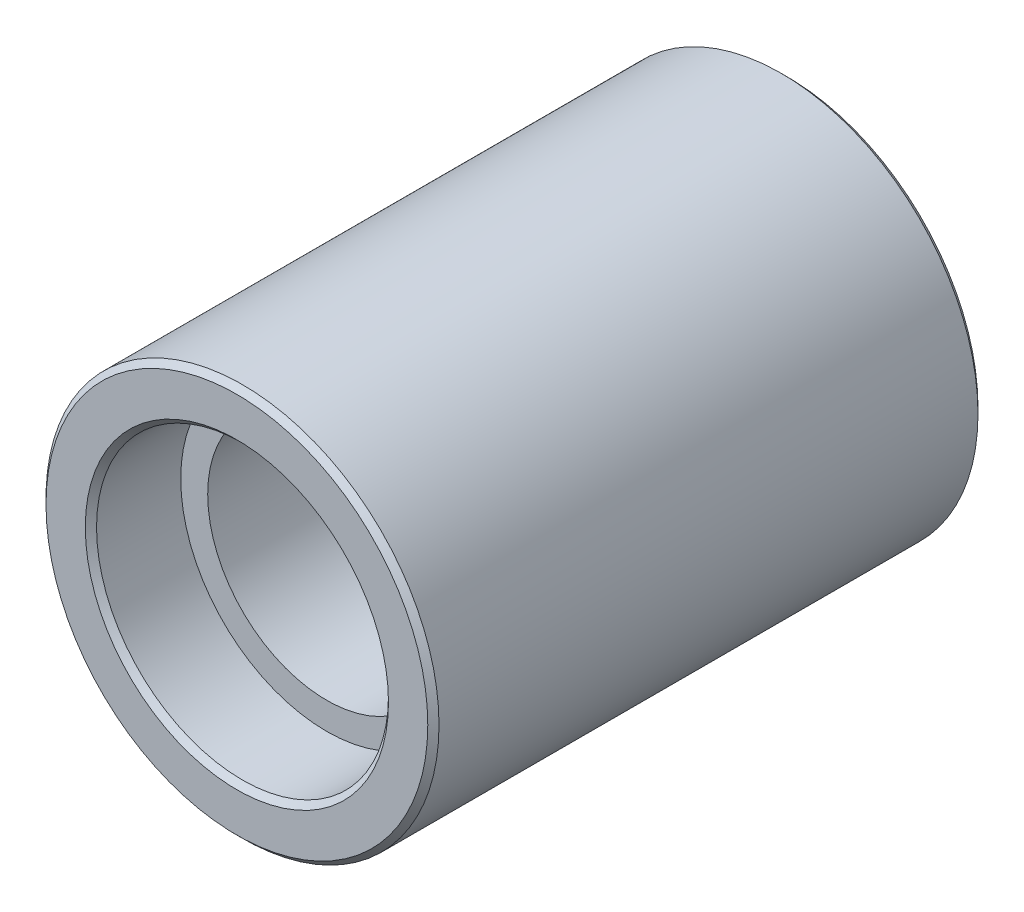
ISO-10303-21;
HEADER;
FILE_DESCRIPTION(('STEP AP214'),'2;1');
FILE_NAME('part.step','',(''),(''),'','','');
FILE_SCHEMA(('AUTOMOTIVE_DESIGN { 1 0 10303 214 1 1 1 1 }'));
ENDSEC;
DATA;
#1=APPLICATION_CONTEXT('core data for automotive mechanical design processes');
#2=APPLICATION_PROTOCOL_DEFINITION('international standard','automotive_design',2000,#1);
#3=PRODUCT_CONTEXT('',#1,'mechanical');
#4=PRODUCT('Part','Part','',(#3));
#5=PRODUCT_RELATED_PRODUCT_CATEGORY('part','',(#4));
#6=PRODUCT_DEFINITION_FORMATION('','',#4);
#7=PRODUCT_DEFINITION_CONTEXT('part definition',#1,'design');
#8=PRODUCT_DEFINITION('design','',#6,#7);
#9=PRODUCT_DEFINITION_SHAPE('','',#8);
#10=(LENGTH_UNIT() NAMED_UNIT(*) SI_UNIT(.MILLI.,.METRE.));
#11=(NAMED_UNIT(*) PLANE_ANGLE_UNIT() SI_UNIT($,.RADIAN.));
#12=(NAMED_UNIT(*) SI_UNIT($,.STERADIAN.) SOLID_ANGLE_UNIT());
#13=UNCERTAINTY_MEASURE_WITH_UNIT(LENGTH_MEASURE(1.E-05),#10,'distance_accuracy_value','');
#14=(GEOMETRIC_REPRESENTATION_CONTEXT(3) GLOBAL_UNCERTAINTY_ASSIGNED_CONTEXT((#13)) GLOBAL_UNIT_ASSIGNED_CONTEXT((#10,
#11,#12)) REPRESENTATION_CONTEXT('',''));
#15=CARTESIAN_POINT('',(0.,0.,0.));
#16=DIRECTION('',(0.,0.,1.));
#17=DIRECTION('',(1.,0.,0.));
#18=AXIS2_PLACEMENT_3D('',#15,#16,#17);
#19=CARTESIAN_POINT('',(0.,0.,24.5));
#20=DIRECTION('',(0.,0.,-1.));
#21=DIRECTION('',(-1.,0.,0.));
#22=AXIS2_PLACEMENT_3D('',#19,#20,#21);
#23=CYLINDRICAL_SURFACE('',#22,10.6);
#24=CARTESIAN_POINT('',(0.,0.,-16.5));
#25=DIRECTION('',(0.,0.,-1.));
#26=DIRECTION('',(-1.,0.,0.));
#27=AXIS2_PLACEMENT_3D('',#24,#25,#26);
#28=CIRCLE('',#27,10.6);
#29=CARTESIAN_POINT('',(-10.6,0.,-16.5));
#30=VERTEX_POINT('',#29);
#31=EDGE_CURVE('E64',#30,#30,#28,.T.);
#32=ORIENTED_EDGE('',*,*,#31,.T.);
#33=EDGE_LOOP('',(#32));
#34=FACE_BOUND('',#33,.T.);
#35=CARTESIAN_POINT('',(0.,0.,16.5));
#36=DIRECTION('',(0.,0.,1.));
#37=DIRECTION('',(1.,0.,0.));
#38=AXIS2_PLACEMENT_3D('',#35,#36,#37);
#39=CIRCLE('',#38,10.6);
#40=CARTESIAN_POINT('',(10.6,0.,16.5));
#41=VERTEX_POINT('',#40);
#42=EDGE_CURVE('E61',#41,#41,#39,.F.);
#43=ORIENTED_EDGE('',*,*,#42,.F.);
#44=EDGE_LOOP('',(#43));
#45=FACE_BOUND('',#44,.T.);
#46=ADVANCED_FACE('F28',(#34,#45),#23,.F.);
#47=CARTESIAN_POINT('',(0.,0.,24.5));
#48=DIRECTION('',(0.,0.,-1.));
#49=DIRECTION('',(-1.,0.,0.));
#50=AXIS2_PLACEMENT_3D('',#47,#48,#49);
#51=CYLINDRICAL_SURFACE('',#50,17.5);
#52=CARTESIAN_POINT('',(0.,0.,-24.));
#53=DIRECTION('',(0.,0.,1.));
#54=DIRECTION('',(1.,0.,0.));
#55=AXIS2_PLACEMENT_3D('',#52,#53,#54);
#56=CIRCLE('',#55,17.5);
#57=CARTESIAN_POINT('',(17.5,0.,-24.));
#58=VERTEX_POINT('',#57);
#59=EDGE_CURVE('E54',#58,#58,#56,.T.);
#60=ORIENTED_EDGE('',*,*,#59,.T.);
#61=EDGE_LOOP('',(#60));
#62=FACE_BOUND('',#61,.T.);
#63=CARTESIAN_POINT('',(0.,0.,24.));
#64=DIRECTION('',(0.,0.,1.));
#65=DIRECTION('',(1.,0.,0.));
#66=AXIS2_PLACEMENT_3D('',#63,#64,#65);
#67=CIRCLE('',#66,17.5);
#68=CARTESIAN_POINT('',(17.5,0.,24.));
#69=VERTEX_POINT('',#68);
#70=EDGE_CURVE('E57',#69,#69,#67,.F.);
#71=ORIENTED_EDGE('',*,*,#70,.T.);
#72=EDGE_LOOP('',(#71));
#73=FACE_BOUND('',#72,.T.);
#74=ADVANCED_FACE('F30',(#62,#73),#51,.T.);
#75=CARTESIAN_POINT('',(0.,0.,24.5));
#76=DIRECTION('',(0.,0.,1.));
#77=DIRECTION('',(1.,0.,0.));
#78=AXIS2_PLACEMENT_3D('',#75,#76,#77);
#79=PLANE('',#78);
#80=CARTESIAN_POINT('',(0.,0.,24.5));
#81=DIRECTION('',(0.,0.,1.));
#82=DIRECTION('',(1.,0.,0.));
#83=AXIS2_PLACEMENT_3D('',#80,#81,#82);
#84=CIRCLE('',#83,13.5);
#85=CARTESIAN_POINT('',(13.5,0.,24.5));
#86=VERTEX_POINT('',#85);
#87=EDGE_CURVE('E10',#86,#86,#84,.F.);
#88=ORIENTED_EDGE('',*,*,#87,.T.);
#89=EDGE_LOOP('',(#88));
#90=FACE_BOUND('',#89,.T.);
#91=CARTESIAN_POINT('',(0.,0.,24.5));
#92=DIRECTION('',(0.,0.,1.));
#93=DIRECTION('',(1.,0.,0.));
#94=AXIS2_PLACEMENT_3D('',#91,#92,#93);
#95=CIRCLE('',#94,17.);
#96=CARTESIAN_POINT('',(17.,0.,24.5));
#97=VERTEX_POINT('',#96);
#98=EDGE_CURVE('E35',#97,#97,#95,.T.);
#99=ORIENTED_EDGE('',*,*,#98,.T.);
#100=EDGE_LOOP('',(#99));
#101=FACE_BOUND('',#100,.T.);
#102=ADVANCED_FACE('F96',(#90,#101),#79,.T.);
#103=CARTESIAN_POINT('',(0.,0.,-24.5));
#104=DIRECTION('',(0.,0.,1.));
#105=DIRECTION('',(1.,0.,0.));
#106=AXIS2_PLACEMENT_3D('',#103,#104,#105);
#107=PLANE('',#106);
#108=CARTESIAN_POINT('',(0.,0.,-24.5));
#109=DIRECTION('',(0.,0.,1.));
#110=DIRECTION('',(1.,0.,0.));
#111=AXIS2_PLACEMENT_3D('',#108,#109,#110);
#112=CIRCLE('',#111,17.);
#113=CARTESIAN_POINT('',(17.,0.,-24.5));
#114=VERTEX_POINT('',#113);
#115=EDGE_CURVE('E48',#114,#114,#112,.F.);
#116=ORIENTED_EDGE('',*,*,#115,.T.);
#117=EDGE_LOOP('',(#116));
#118=FACE_BOUND('',#117,.T.);
#119=CARTESIAN_POINT('',(0.,0.,-24.5));
#120=DIRECTION('',(0.,0.,1.));
#121=DIRECTION('',(1.,0.,0.));
#122=AXIS2_PLACEMENT_3D('',#119,#120,#121);
#123=CIRCLE('',#122,13.5);
#124=CARTESIAN_POINT('',(13.5,0.,-24.5));
#125=VERTEX_POINT('',#124);
#126=EDGE_CURVE('E51',#125,#125,#123,.T.);
#127=ORIENTED_EDGE('',*,*,#126,.T.);
#128=EDGE_LOOP('',(#127));
#129=FACE_BOUND('',#128,.T.);
#130=ADVANCED_FACE('F106',(#118,#129),#107,.F.);
#131=CARTESIAN_POINT('',(0.,0.,-16.5));
#132=DIRECTION('',(0.,0.,-1.));
#133=DIRECTION('',(-1.,0.,0.));
#134=AXIS2_PLACEMENT_3D('',#131,#132,#133);
#135=CYLINDRICAL_SURFACE('',#134,13.);
#136=CARTESIAN_POINT('',(0.,0.,-24.));
#137=DIRECTION('',(0.,0.,1.));
#138=DIRECTION('',(1.,0.,0.));
#139=AXIS2_PLACEMENT_3D('',#136,#137,#138);
#140=CIRCLE('',#139,13.);
#141=CARTESIAN_POINT('',(13.,0.,-24.));
#142=VERTEX_POINT('',#141);
#143=EDGE_CURVE('E43',#142,#142,#140,.F.);
#144=ORIENTED_EDGE('',*,*,#143,.T.);
#145=EDGE_LOOP('',(#144));
#146=FACE_BOUND('',#145,.T.);
#147=CARTESIAN_POINT('',(0.,0.,-16.5));
#148=DIRECTION('',(0.,0.,-1.));
#149=DIRECTION('',(-1.,0.,0.));
#150=AXIS2_PLACEMENT_3D('',#147,#148,#149);
#151=CIRCLE('',#150,13.);
#152=CARTESIAN_POINT('',(-13.,0.,-16.5));
#153=VERTEX_POINT('',#152);
#154=EDGE_CURVE('E60',#153,#153,#151,.T.);
#155=ORIENTED_EDGE('',*,*,#154,.F.);
#156=EDGE_LOOP('',(#155));
#157=FACE_BOUND('',#156,.T.);
#158=ADVANCED_FACE('F102',(#146,#157),#135,.F.);
#159=CARTESIAN_POINT('',(0.,0.,-16.5));
#160=DIRECTION('',(0.,0.,-1.));
#161=DIRECTION('',(-1.,0.,0.));
#162=AXIS2_PLACEMENT_3D('',#159,#160,#161);
#163=PLANE('',#162);
#164=ORIENTED_EDGE('',*,*,#31,.F.);
#165=EDGE_LOOP('',(#164));
#166=FACE_BOUND('',#165,.T.);
#167=ORIENTED_EDGE('',*,*,#154,.T.);
#168=EDGE_LOOP('',(#167));
#169=FACE_BOUND('',#168,.T.);
#170=ADVANCED_FACE('F88',(#166,#169),#163,.T.);
#171=CARTESIAN_POINT('',(0.,0.,16.5));
#172=DIRECTION('',(0.,0.,1.));
#173=DIRECTION('',(1.,0.,0.));
#174=AXIS2_PLACEMENT_3D('',#171,#172,#173);
#175=PLANE('',#174);
#176=CARTESIAN_POINT('',(0.,0.,16.5));
#177=DIRECTION('',(0.,0.,1.));
#178=DIRECTION('',(1.,0.,0.));
#179=AXIS2_PLACEMENT_3D('',#176,#177,#178);
#180=CIRCLE('',#179,13.);
#181=CARTESIAN_POINT('',(13.,0.,16.5));
#182=VERTEX_POINT('',#181);
#183=EDGE_CURVE('E65',#182,#182,#180,.T.);
#184=ORIENTED_EDGE('',*,*,#183,.T.);
#185=EDGE_LOOP('',(#184));
#186=FACE_BOUND('',#185,.T.);
#187=ORIENTED_EDGE('',*,*,#42,.T.);
#188=EDGE_LOOP('',(#187));
#189=FACE_BOUND('',#188,.T.);
#190=ADVANCED_FACE('F73',(#186,#189),#175,.T.);
#191=CARTESIAN_POINT('',(0.,0.,16.5));
#192=DIRECTION('',(0.,0.,1.));
#193=DIRECTION('',(1.,0.,0.));
#194=AXIS2_PLACEMENT_3D('',#191,#192,#193);
#195=CYLINDRICAL_SURFACE('',#194,13.);
#196=CARTESIAN_POINT('',(0.,0.,24.));
#197=DIRECTION('',(0.,0.,1.));
#198=DIRECTION('',(1.,0.,0.));
#199=AXIS2_PLACEMENT_3D('',#196,#197,#198);
#200=CIRCLE('',#199,13.);
#201=CARTESIAN_POINT('',(13.,0.,24.));
#202=VERTEX_POINT('',#201);
#203=EDGE_CURVE('E39',#202,#202,#200,.T.);
#204=ORIENTED_EDGE('',*,*,#203,.T.);
#205=EDGE_LOOP('',(#204));
#206=FACE_BOUND('',#205,.T.);
#207=ORIENTED_EDGE('',*,*,#183,.F.);
#208=EDGE_LOOP('',(#207));
#209=FACE_BOUND('',#208,.T.);
#210=ADVANCED_FACE('F76',(#206,#209),#195,.F.);
#211=CARTESIAN_POINT('',(0.,0.,-24.));
#212=DIRECTION('',(0.,0.,1.));
#213=DIRECTION('',(1.,0.,0.));
#214=AXIS2_PLACEMENT_3D('',#211,#212,#213);
#215=CONICAL_SURFACE('',#214,17.5,0.785398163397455);
#216=ORIENTED_EDGE('',*,*,#115,.F.);
#217=EDGE_LOOP('',(#216));
#218=FACE_BOUND('',#217,.T.);
#219=ORIENTED_EDGE('',*,*,#59,.F.);
#220=EDGE_LOOP('',(#219));
#221=FACE_BOUND('',#220,.T.);
#222=ADVANCED_FACE('F78',(#218,#221),#215,.T.);
#223=CARTESIAN_POINT('',(0.,0.,-24.));
#224=DIRECTION('',(0.,0.,-1.));
#225=DIRECTION('',(-1.,0.,0.));
#226=AXIS2_PLACEMENT_3D('',#223,#224,#225);
#227=CONICAL_SURFACE('',#226,13.,0.785398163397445);
#228=ORIENTED_EDGE('',*,*,#126,.F.);
#229=EDGE_LOOP('',(#228));
#230=FACE_BOUND('',#229,.T.);
#231=ORIENTED_EDGE('',*,*,#143,.F.);
#232=EDGE_LOOP('',(#231));
#233=FACE_BOUND('',#232,.T.);
#234=ADVANCED_FACE('F85',(#230,#233),#227,.F.);
#235=CARTESIAN_POINT('',(0.,0.,24.));
#236=DIRECTION('',(0.,0.,1.));
#237=DIRECTION('',(1.,0.,0.));
#238=AXIS2_PLACEMENT_3D('',#235,#236,#237);
#239=CONICAL_SURFACE('',#238,13.,0.785398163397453);
#240=ORIENTED_EDGE('',*,*,#87,.F.);
#241=EDGE_LOOP('',(#240));
#242=FACE_BOUND('',#241,.T.);
#243=ORIENTED_EDGE('',*,*,#203,.F.);
#244=EDGE_LOOP('',(#243));
#245=FACE_BOUND('',#244,.T.);
#246=ADVANCED_FACE('F170',(#242,#245),#239,.F.);
#247=CARTESIAN_POINT('',(0.,0.,24.5));
#248=DIRECTION('',(0.,0.,-1.));
#249=DIRECTION('',(-1.,0.,0.));
#250=AXIS2_PLACEMENT_3D('',#247,#248,#249);
#251=CONICAL_SURFACE('',#250,17.,0.785398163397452);
#252=ORIENTED_EDGE('',*,*,#70,.F.);
#253=EDGE_LOOP('',(#252));
#254=FACE_BOUND('',#253,.T.);
#255=ORIENTED_EDGE('',*,*,#98,.F.);
#256=EDGE_LOOP('',(#255));
#257=FACE_BOUND('',#256,.T.);
#258=ADVANCED_FACE('F179',(#254,#257),#251,.T.);
#259=CLOSED_SHELL('',(#46,#74,#102,#130,#158,#170,#190,#210,#222,#234,#246,#258));
#260=MANIFOLD_SOLID_BREP('B2',#259);
#261=ADVANCED_BREP_SHAPE_REPRESENTATION('',(#18,#260),#14);
#262=SHAPE_DEFINITION_REPRESENTATION(#9,#261);
ENDSEC;
END-ISO-10303-21;
